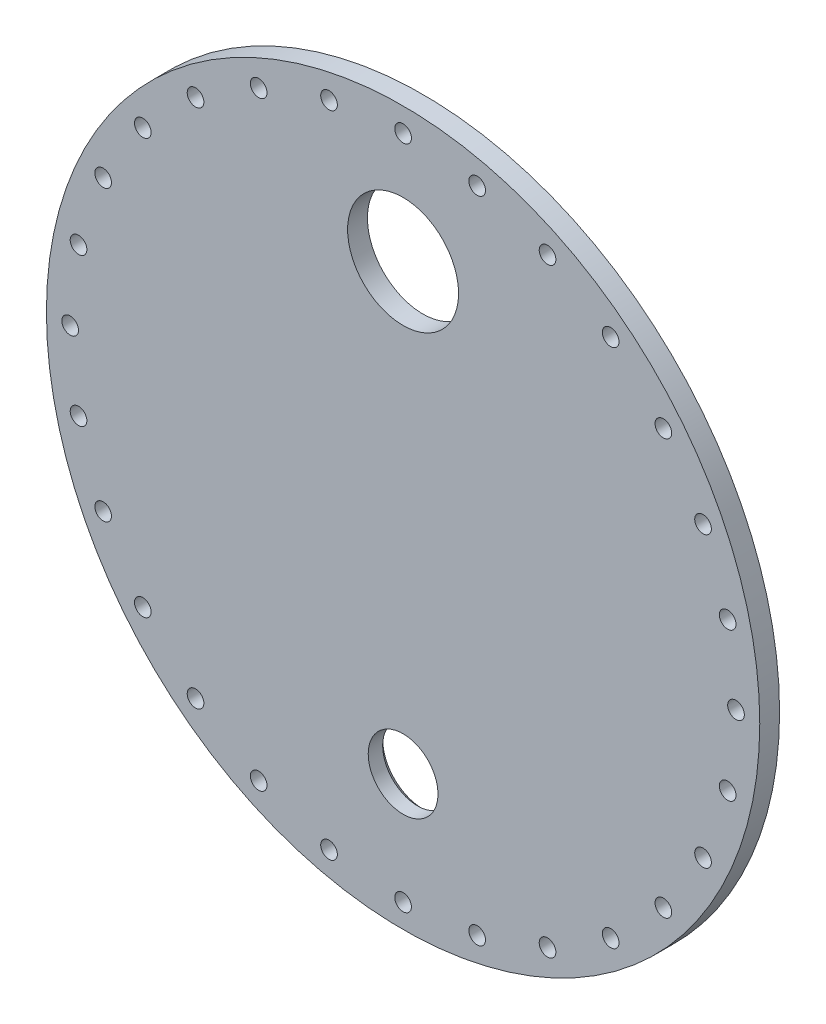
from build123d import *

# Parameters (mm, degrees)
CROQUIS1_R              = 225
SALIENTE_EXTRUIR1_DEPTH = 12.5
CROQUIS3_R              = 5.25
CORTAR_EXTRUIR4_DEPTH   = 12.5
MATRIZC1_COUNT          = 28
CROQUIS6_R              = 35
CORTAR_EXTRUIR11_DEPTH  = 12.5


with BuildPart() as part:
    # Croquis1 → Saliente-Extruir1 (new body)
    with BuildSketch(Plane.XY):
        Circle(CROQUIS1_R)
    extrude(amount=SALIENTE_EXTRUIR1_DEPTH)

    # Croquis3 → Cortar-Extruir4 (cut)
    with BuildSketch(Plane.XY.offset(12.5)):
        with Locations((0, 210)):
            Circle(CROQUIS3_R)
    cortar_extruir4 = extrude(amount=-CORTAR_EXTRUIR4_DEPTH, mode=Mode.SUBTRACT)

    # MatrizC1: Cortar-Extruir4 ×28 about axis
    matrizc1_axis = Axis((0, 0, 0), (0, 0, 1))
    for i in range(1, MATRIZC1_COUNT):
        add(cortar_extruir4.rotate(matrizc1_axis, i * 360 / MATRIZC1_COUNT), mode=Mode.SUBTRACT)

    # Croquis6 → Cortar-Extruir11 (cut)
    with BuildSketch(Plane.XY.offset(12.5)):
        with Locations((0, 140)):
            Circle(CROQUIS6_R)
    extrude(amount=-CORTAR_EXTRUIR11_DEPTH, mode=Mode.SUBTRACT)

    # Croquis46 → Refrentado para tornillo tap_n con cabez (revolve, cut)
    with BuildSketch(Plane(origin=(0, -140, 0), x_dir=(0, 1, 0), z_dir=(1, 0, 0))):
        Polygon((0, 0), (0, 12.5), (22, 12.5), (22, 3.4), (25.4, 0), align=None)
    revolve(axis=Axis((0, -140, -6.35), (0, 0, 1)), mode=Mode.SUBTRACT)


solid = part.part
